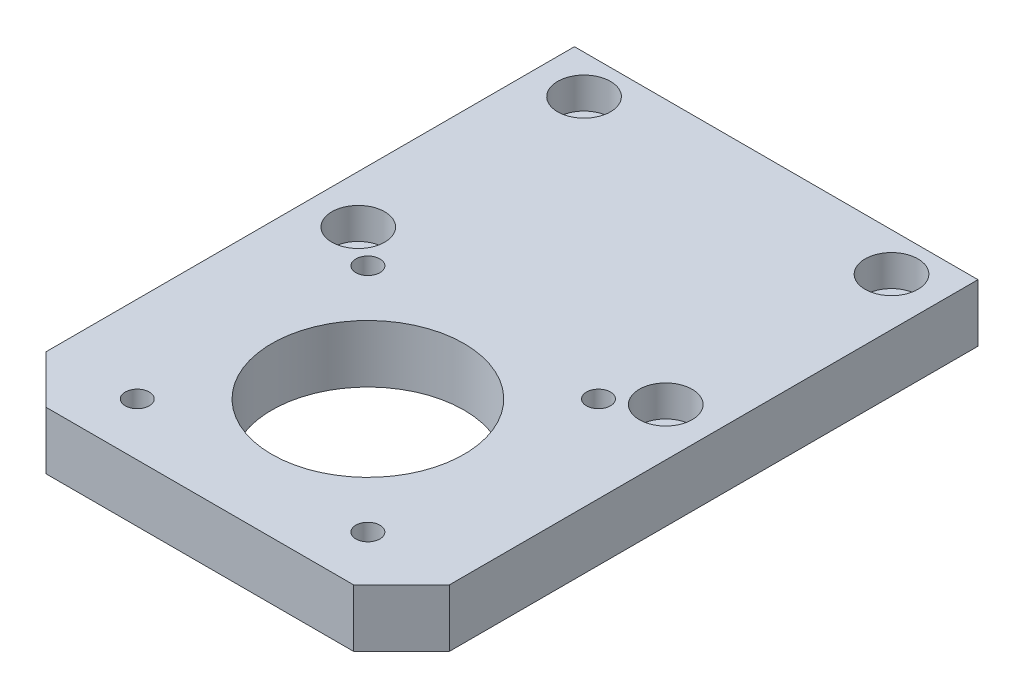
from build123d import *

# Parameters (mm, degrees)
SKETCH_1_W           = 84
SKETCH_1_H           = 12
EXTRUDE_1_DEPTH      = 120
SKETCH_2_OUTSIDE_W   = 115.394
SKETCH_2_OUTSIDE_H   = 151.394
SKETCH_2_OUTSIDE_R   = 3.25
SKETCH_2_OUTSIDE_R_2 = 2.5
SKETCH_2_OUTSIDE_R_3 = 20
CUT_EXTRUDE_1_DEPTH  = 120
SKETCH_3_R           = 5.5
CUT_EXTRUDE_2_DEPTH  = 6.5


with BuildPart() as part:
    # Sketch 1 → Extrude 1 (new body)
    with BuildSketch(Plane.XY):
        with Locations((42, 6)):
            Rectangle(SKETCH_1_W, SKETCH_1_H)
    extrude(amount=EXTRUDE_1_DEPTH)

    # Sketch 2 outside → Cut-Extrude 1 (cut)
    # profile 1 of 10: a face of its own
    with BuildSketch(Plane(origin=(0, 12, 0), x_dir=(1, 0, 0), z_dir=(0, 1, 0))):
        with Locations((42, -60)):
            Rectangle(SKETCH_2_OUTSIDE_W, SKETCH_2_OUTSIDE_H)
        Polygon((10, -120), (74, -120), (84, -110), (84, 0), (0, 0), (0, -110), align=None, mode=Mode.SUBTRACT)
    # profile 2 of 10: a face of its own
    with BuildSketch(Plane(origin=(0, 12, 0), x_dir=(1, 0, 0), z_dir=(0, 1, 0))):
        with Locations(Location((10, -55, 0), (0, 0, 270))):
            Circle(SKETCH_2_OUTSIDE_R)
    # profile 3 of 10: a face of its own
    with BuildSketch(Plane(origin=(0, 12, 0), x_dir=(1, 0, 0), z_dir=(0, 1, 0))):
        with Locations(Location((74, -55, 0), (0, 0, 270))):
            Circle(SKETCH_2_OUTSIDE_R)
    # profile 4 of 10: a face of its own
    with BuildSketch(Plane(origin=(0, 12, 0), x_dir=(1, 0, 0), z_dir=(0, 1, 0))):
        with Locations(Location((18, -61, 0), (0, 0, 270))):
            Circle(SKETCH_2_OUTSIDE_R_2)
    # profile 5 of 10: a face of its own
    with BuildSketch(Plane(origin=(0, 12, 0), x_dir=(1, 0, 0), z_dir=(0, 1, 0))):
        with Locations(Location((66, -61, 0), (0, 0, 270))):
            Circle(SKETCH_2_OUTSIDE_R_2)
    # profile 6 of 10: a face of its own
    with BuildSketch(Plane(origin=(0, 12, 0), x_dir=(1, 0, 0), z_dir=(0, 1, 0))):
        with Locations(Location((66, -109, 0), (0, 0, 270))):
            Circle(SKETCH_2_OUTSIDE_R_2)
    # profile 7 of 10: a face of its own
    with BuildSketch(Plane(origin=(0, 12, 0), x_dir=(1, 0, 0), z_dir=(0, 1, 0))):
        with Locations(Location((18, -109, 0), (0, 0, 270))):
            Circle(SKETCH_2_OUTSIDE_R_2)
    # profile 8 of 10: a face of its own
    with BuildSketch(Plane(origin=(0, 12, 0), x_dir=(1, 0, 0), z_dir=(0, 1, 0))):
        with Locations(Location((42, -85, 0), (0, 0, 270))):
            Circle(SKETCH_2_OUTSIDE_R_3)
    # profile 9 of 10: a face of its own
    with BuildSketch(Plane(origin=(0, 12, 0), x_dir=(1, 0, 0), z_dir=(0, 1, 0))):
        with Locations(Location((74, -8, 0), (0, 0, 270))):
            Circle(SKETCH_2_OUTSIDE_R)
    # profile 10 of 10: a face of its own
    with BuildSketch(Plane(origin=(0, 12, 0), x_dir=(1, 0, 0), z_dir=(0, 1, 0))):
        with Locations(Location((10, -8, 0), (0, 0, 270))):
            Circle(SKETCH_2_OUTSIDE_R)
    extrude(amount=-CUT_EXTRUDE_1_DEPTH, mode=Mode.SUBTRACT)

    # Sketch 3 → Cut-Extrude 2 (cut)
    with BuildSketch(Plane(origin=(0, 12, 0), x_dir=(1, 0, 0), z_dir=(0, 1, 0))):
        with Locations(Location((10, -55, 0), (0, 0, 270))):
            Circle(SKETCH_3_R)
        with Locations(Location((74, -55, 0), (0, 0, 270))):
            Circle(SKETCH_3_R)
        with Locations(Location((74, -8, 0), (0, 0, 270))):
            Circle(SKETCH_3_R)
        with Locations(Location((10, -8, 0), (0, 0, 270))):
            Circle(SKETCH_3_R)
    extrude(amount=-CUT_EXTRUDE_2_DEPTH, mode=Mode.SUBTRACT)


solid = part.part
